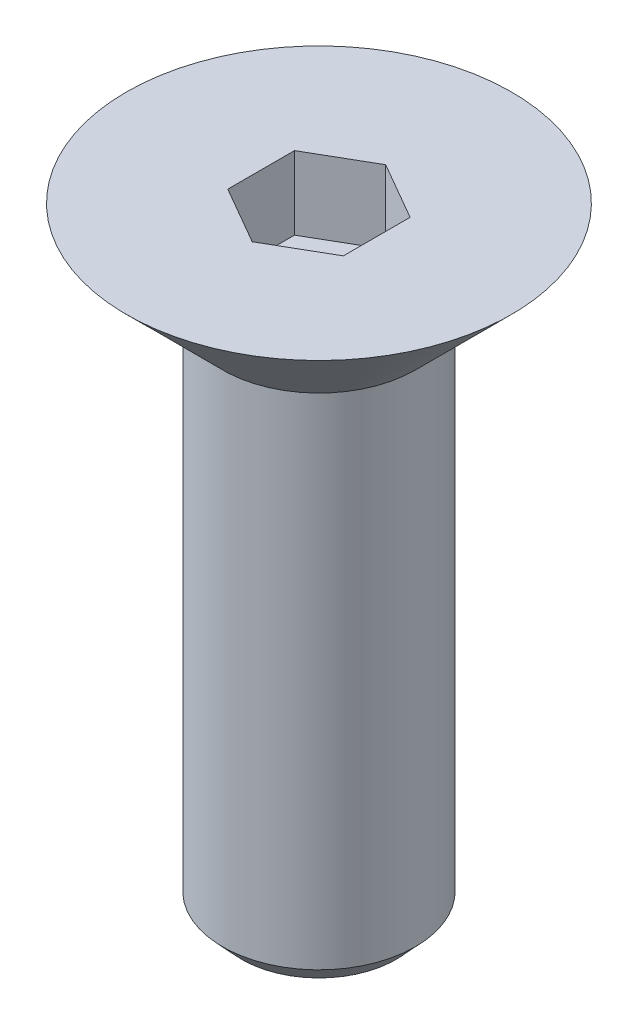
ISO-10303-21;
HEADER;
FILE_DESCRIPTION(('STEP AP214'),'2;1');
FILE_NAME('part.step','',(''),(''),'','','');
FILE_SCHEMA(('AUTOMOTIVE_DESIGN { 1 0 10303 214 1 1 1 1 }'));
ENDSEC;
DATA;
#1=APPLICATION_CONTEXT('core data for automotive mechanical design processes');
#2=APPLICATION_PROTOCOL_DEFINITION('international standard','automotive_design',2000,#1);
#3=PRODUCT_CONTEXT('',#1,'mechanical');
#4=PRODUCT('Part','Part','',(#3));
#5=PRODUCT_RELATED_PRODUCT_CATEGORY('part','',(#4));
#6=PRODUCT_DEFINITION_FORMATION('','',#4);
#7=PRODUCT_DEFINITION_CONTEXT('part definition',#1,'design');
#8=PRODUCT_DEFINITION('design','',#6,#7);
#9=PRODUCT_DEFINITION_SHAPE('','',#8);
#10=(LENGTH_UNIT() NAMED_UNIT(*) SI_UNIT(.MILLI.,.METRE.));
#11=(NAMED_UNIT(*) PLANE_ANGLE_UNIT() SI_UNIT($,.RADIAN.));
#12=(NAMED_UNIT(*) SI_UNIT($,.STERADIAN.) SOLID_ANGLE_UNIT());
#13=UNCERTAINTY_MEASURE_WITH_UNIT(LENGTH_MEASURE(1.E-05),#10,'distance_accuracy_value','');
#14=(GEOMETRIC_REPRESENTATION_CONTEXT(3) GLOBAL_UNCERTAINTY_ASSIGNED_CONTEXT((#13)) GLOBAL_UNIT_ASSIGNED_CONTEXT((#10,
#11,#12)) REPRESENTATION_CONTEXT('',''));
#15=CARTESIAN_POINT('',(0.,0.,0.));
#16=DIRECTION('',(0.,0.,1.));
#17=DIRECTION('',(1.,0.,0.));
#18=AXIS2_PLACEMENT_3D('',#15,#16,#17);
#19=CARTESIAN_POINT('',(-1.49999999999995,-1.90000000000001,0.866025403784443));
#20=DIRECTION('',(-1.,0.,0.));
#21=DIRECTION('',(0.,0.,1.));
#22=AXIS2_PLACEMENT_3D('',#19,#20,#21);
#23=PLANE('',#22);
#24=DIRECTION('',(0.,1.,0.));
#25=VECTOR('',#24,1.);
#26=CARTESIAN_POINT('',(-1.49999999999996,-1.90000000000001,0.86602540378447));
#27=LINE('',#26,#25);
#28=CARTESIAN_POINT('',(-1.49999999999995,0.,0.866025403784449));
#29=VERTEX_POINT('',#28);
#30=CARTESIAN_POINT('',(-1.49999999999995,-1.90000000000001,0.86602540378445));
#31=VERTEX_POINT('',#30);
#32=EDGE_CURVE('E83',#29,#31,#27,.F.);
#33=ORIENTED_EDGE('',*,*,#32,.T.);
#34=DIRECTION('',(0.,0.,1.));
#35=VECTOR('',#34,1.);
#36=CARTESIAN_POINT('',(-1.49999999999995,-1.90000000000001,0.866025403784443));
#37=LINE('',#36,#35);
#38=CARTESIAN_POINT('',(-1.49999999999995,-1.90000000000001,-0.866025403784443));
#39=VERTEX_POINT('',#38);
#40=EDGE_CURVE('E72',#39,#31,#37,.T.);
#41=ORIENTED_EDGE('',*,*,#40,.F.);
#42=DIRECTION('',(0.,1.,0.));
#43=VECTOR('',#42,1.);
#44=CARTESIAN_POINT('',(-1.49999999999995,-1.90000000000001,-0.866025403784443));
#45=LINE('',#44,#43);
#46=CARTESIAN_POINT('',(-1.49999999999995,0.,-0.866025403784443));
#47=VERTEX_POINT('',#46);
#48=EDGE_CURVE('E92',#39,#47,#45,.T.);
#49=ORIENTED_EDGE('',*,*,#48,.T.);
#50=DIRECTION('',(0.,0.,1.));
#51=VECTOR('',#50,1.);
#52=CARTESIAN_POINT('',(-1.49999999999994,0.,0.866025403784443));
#53=LINE('',#52,#51);
#54=EDGE_CURVE('E67',#29,#47,#53,.F.);
#55=ORIENTED_EDGE('',*,*,#54,.F.);
#56=EDGE_LOOP('',(#33,#41,#49,#55));
#57=FACE_BOUND('',#56,.T.);
#58=ADVANCED_FACE('F17',(#57),#23,.F.);
#59=CARTESIAN_POINT('',(0.,-1.90000000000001,1.73205080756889));
#60=DIRECTION('',(-0.5,0.,0.866025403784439));
#61=DIRECTION('',(0.866025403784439,0.,0.5));
#62=AXIS2_PLACEMENT_3D('',#59,#60,#61);
#63=PLANE('',#62);
#64=DIRECTION('',(0.,1.,0.));
#65=VECTOR('',#64,1.);
#66=CARTESIAN_POINT('',(0.,-1.90000000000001,1.73205080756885));
#67=LINE('',#66,#65);
#68=CARTESIAN_POINT('',(0.,0.,1.73205080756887));
#69=VERTEX_POINT('',#68);
#70=CARTESIAN_POINT('',(0.,-1.90000000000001,1.73205080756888));
#71=VERTEX_POINT('',#70);
#72=EDGE_CURVE('E88',#69,#71,#67,.F.);
#73=ORIENTED_EDGE('',*,*,#72,.T.);
#74=DIRECTION('',(0.866025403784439,0.,0.5));
#75=VECTOR('',#74,1.);
#76=CARTESIAN_POINT('',(0.,-1.90000000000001,1.73205080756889));
#77=LINE('',#76,#75);
#78=EDGE_CURVE('E76',#31,#71,#77,.T.);
#79=ORIENTED_EDGE('',*,*,#78,.F.);
#80=ORIENTED_EDGE('',*,*,#32,.F.);
#81=DIRECTION('',(0.866025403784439,0.,0.5));
#82=VECTOR('',#81,1.);
#83=CARTESIAN_POINT('',(0.,0.,1.73205080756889));
#84=LINE('',#83,#82);
#85=EDGE_CURVE('E90',#69,#29,#84,.F.);
#86=ORIENTED_EDGE('',*,*,#85,.F.);
#87=EDGE_LOOP('',(#73,#79,#80,#86));
#88=FACE_BOUND('',#87,.T.);
#89=ADVANCED_FACE('F86',(#88),#63,.F.);
#90=CARTESIAN_POINT('',(-1.49999999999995,-1.90000000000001,-0.866025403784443));
#91=DIRECTION('',(-0.500000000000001,0.,-0.866025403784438));
#92=DIRECTION('',(-0.866025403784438,0.,0.500000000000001));
#93=AXIS2_PLACEMENT_3D('',#90,#91,#92);
#94=PLANE('',#93);
#95=ORIENTED_EDGE('',*,*,#48,.F.);
#96=DIRECTION('',(0.86602540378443,0.,-0.500000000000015));
#97=VECTOR('',#96,1.);
#98=CARTESIAN_POINT('',(-1.49999999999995,-1.90000000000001,-0.866025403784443));
#99=LINE('',#98,#97);
#100=CARTESIAN_POINT('',(0.,-1.90000000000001,-1.73205080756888));
#101=VERTEX_POINT('',#100);
#102=EDGE_CURVE('E79',#39,#101,#99,.T.);
#103=ORIENTED_EDGE('',*,*,#102,.T.);
#104=DIRECTION('',(0.,1.,0.));
#105=VECTOR('',#104,1.);
#106=CARTESIAN_POINT('',(0.,-1.90000000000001,-1.73205080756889));
#107=LINE('',#106,#105);
#108=CARTESIAN_POINT('',(0.,0.,-1.73205080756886));
#109=VERTEX_POINT('',#108);
#110=EDGE_CURVE('E117',#101,#109,#107,.T.);
#111=ORIENTED_EDGE('',*,*,#110,.T.);
#112=DIRECTION('',(-0.866025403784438,0.,0.500000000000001));
#113=VECTOR('',#112,1.);
#114=CARTESIAN_POINT('',(-1.49999999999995,0.,-0.866025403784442));
#115=LINE('',#114,#113);
#116=EDGE_CURVE('E128',#47,#109,#115,.F.);
#117=ORIENTED_EDGE('',*,*,#116,.F.);
#118=EDGE_LOOP('',(#95,#103,#111,#117));
#119=FACE_BOUND('',#118,.T.);
#120=ADVANCED_FACE('F131',(#119),#94,.F.);
#121=CARTESIAN_POINT('',(1.49999999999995,-1.90000000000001,0.866025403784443));
#122=DIRECTION('',(0.500000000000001,0.,0.866025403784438));
#123=DIRECTION('',(0.866025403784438,0.,-0.500000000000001));
#124=AXIS2_PLACEMENT_3D('',#121,#122,#123);
#125=PLANE('',#124);
#126=DIRECTION('',(0.,1.,0.));
#127=VECTOR('',#126,1.);
#128=CARTESIAN_POINT('',(1.49999999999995,-1.90000000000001,0.866025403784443));
#129=LINE('',#128,#127);
#130=CARTESIAN_POINT('',(1.49999999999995,0.,0.866025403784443));
#131=VERTEX_POINT('',#130);
#132=CARTESIAN_POINT('',(1.49999999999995,-1.90000000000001,0.866025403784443));
#133=VERTEX_POINT('',#132);
#134=EDGE_CURVE('E114',#131,#133,#129,.F.);
#135=ORIENTED_EDGE('',*,*,#134,.T.);
#136=DIRECTION('',(-0.86602540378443,0.,0.500000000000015));
#137=VECTOR('',#136,1.);
#138=CARTESIAN_POINT('',(1.49999999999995,-1.90000000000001,0.866025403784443));
#139=LINE('',#138,#137);
#140=EDGE_CURVE('E122',#133,#71,#139,.T.);
#141=ORIENTED_EDGE('',*,*,#140,.T.);
#142=ORIENTED_EDGE('',*,*,#72,.F.);
#143=DIRECTION('',(0.866025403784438,0.,-0.500000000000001));
#144=VECTOR('',#143,1.);
#145=CARTESIAN_POINT('',(1.49999999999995,0.,0.866025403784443));
#146=LINE('',#145,#144);
#147=EDGE_CURVE('E125',#131,#69,#146,.F.);
#148=ORIENTED_EDGE('',*,*,#147,.F.);
#149=EDGE_LOOP('',(#135,#141,#142,#148));
#150=FACE_BOUND('',#149,.T.);
#151=ADVANCED_FACE('F136',(#150),#125,.F.);
#152=CARTESIAN_POINT('',(0.,-1.90000000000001,1.73205080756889));
#153=DIRECTION('',(0.,-1.,0.));
#154=DIRECTION('',(1.,0.,0.));
#155=AXIS2_PLACEMENT_3D('',#152,#153,#154);
#156=PLANE('',#155);
#157=DIRECTION('',(0.,0.,-1.));
#158=VECTOR('',#157,1.);
#159=CARTESIAN_POINT('',(1.49999999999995,-1.90000000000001,-0.866025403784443));
#160=LINE('',#159,#158);
#161=CARTESIAN_POINT('',(1.49999999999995,-1.90000000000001,-0.866025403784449));
#162=VERTEX_POINT('',#161);
#163=EDGE_CURVE('E110',#133,#162,#160,.T.);
#164=ORIENTED_EDGE('',*,*,#163,.T.);
#165=DIRECTION('',(-0.866025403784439,0.,-0.5));
#166=VECTOR('',#165,1.);
#167=CARTESIAN_POINT('',(0.,-1.90000000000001,-1.73205080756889));
#168=LINE('',#167,#166);
#169=EDGE_CURVE('E120',#162,#101,#168,.T.);
#170=ORIENTED_EDGE('',*,*,#169,.T.);
#171=ORIENTED_EDGE('',*,*,#102,.F.);
#172=ORIENTED_EDGE('',*,*,#40,.T.);
#173=ORIENTED_EDGE('',*,*,#78,.T.);
#174=ORIENTED_EDGE('',*,*,#140,.F.);
#175=EDGE_LOOP('',(#164,#170,#171,#172,#173,#174));
#176=FACE_BOUND('',#175,.T.);
#177=ADVANCED_FACE('F73',(#176),#156,.F.);
#178=CARTESIAN_POINT('',(0.,-1.90000000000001,-1.73205080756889));
#179=DIRECTION('',(0.5,0.,-0.866025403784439));
#180=DIRECTION('',(-0.866025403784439,0.,-0.5));
#181=AXIS2_PLACEMENT_3D('',#178,#179,#180);
#182=PLANE('',#181);
#183=ORIENTED_EDGE('',*,*,#110,.F.);
#184=ORIENTED_EDGE('',*,*,#169,.F.);
#185=DIRECTION('',(0.,1.,0.));
#186=VECTOR('',#185,1.);
#187=CARTESIAN_POINT('',(1.49999999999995,-1.90000000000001,-0.866025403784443));
#188=LINE('',#187,#186);
#189=CARTESIAN_POINT('',(1.49999999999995,0.,-0.866025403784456));
#190=VERTEX_POINT('',#189);
#191=EDGE_CURVE('E106',#162,#190,#188,.T.);
#192=ORIENTED_EDGE('',*,*,#191,.T.);
#193=DIRECTION('',(-0.866025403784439,0.,-0.5));
#194=VECTOR('',#193,1.);
#195=CARTESIAN_POINT('',(0.,0.,-1.73205080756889));
#196=LINE('',#195,#194);
#197=EDGE_CURVE('E35',#109,#190,#196,.F.);
#198=ORIENTED_EDGE('',*,*,#197,.F.);
#199=EDGE_LOOP('',(#183,#184,#192,#198));
#200=FACE_BOUND('',#199,.T.);
#201=ADVANCED_FACE('F143',(#200),#182,.F.);
#202=CARTESIAN_POINT('',(1.49999999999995,-1.90000000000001,-0.866025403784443));
#203=DIRECTION('',(1.,0.,0.));
#204=DIRECTION('',(0.,0.,-1.));
#205=AXIS2_PLACEMENT_3D('',#202,#203,#204);
#206=PLANE('',#205);
#207=ORIENTED_EDGE('',*,*,#191,.F.);
#208=ORIENTED_EDGE('',*,*,#163,.F.);
#209=ORIENTED_EDGE('',*,*,#134,.F.);
#210=DIRECTION('',(0.,0.,1.));
#211=VECTOR('',#210,1.);
#212=CARTESIAN_POINT('',(1.49999999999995,0.,0.));
#213=LINE('',#212,#211);
#214=EDGE_CURVE('E103',#190,#131,#213,.T.);
#215=ORIENTED_EDGE('',*,*,#214,.F.);
#216=EDGE_LOOP('',(#207,#208,#209,#215));
#217=FACE_BOUND('',#216,.T.);
#218=ADVANCED_FACE('F141',(#217),#206,.F.);
#219=CARTESIAN_POINT('',(0.,-16.,0.));
#220=DIRECTION('',(0.,1.,0.));
#221=DIRECTION('',(-1.,0.,0.));
#222=AXIS2_PLACEMENT_3D('',#219,#220,#221);
#223=PLANE('',#222);
#224=CARTESIAN_POINT('',(0.,-15.9999999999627,0.));
#225=DIRECTION('',(0.,1.,0.));
#226=DIRECTION('',(-1.,0.,0.));
#227=AXIS2_PLACEMENT_3D('',#224,#225,#226);
#228=CIRCLE('',#227,2.00000000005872);
#229=CARTESIAN_POINT('',(-2.00000000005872,-15.9999999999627,0.));
#230=VERTEX_POINT('',#229);
#231=EDGE_CURVE('E20',#230,#230,#228,.T.);
#232=ORIENTED_EDGE('',*,*,#231,.F.);
#233=EDGE_LOOP('',(#232));
#234=FACE_BOUND('',#233,.T.);
#235=ADVANCED_FACE('F151',(#234),#223,.F.);
#236=CARTESIAN_POINT('',(0.,0.,0.));
#237=DIRECTION('',(0.,1.,0.));
#238=DIRECTION('',(-1.,0.,0.));
#239=AXIS2_PLACEMENT_3D('',#236,#237,#238);
#240=PLANE('',#239);
#241=CARTESIAN_POINT('',(0.,5.68432167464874E-11,0.));
#242=DIRECTION('',(0.,1.,0.));
#243=DIRECTION('',(-1.,0.,0.));
#244=AXIS2_PLACEMENT_3D('',#241,#242,#243);
#245=CIRCLE('',#244,4.99999999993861);
#246=CARTESIAN_POINT('',(-4.99999999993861,5.68411434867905E-11,0.));
#247=VERTEX_POINT('',#246);
#248=EDGE_CURVE('E96',#247,#247,#245,.F.);
#249=ORIENTED_EDGE('',*,*,#248,.F.);
#250=EDGE_LOOP('',(#249));
#251=FACE_BOUND('',#250,.T.);
#252=ORIENTED_EDGE('',*,*,#197,.T.);
#253=ORIENTED_EDGE('',*,*,#214,.T.);
#254=ORIENTED_EDGE('',*,*,#147,.T.);
#255=ORIENTED_EDGE('',*,*,#85,.T.);
#256=ORIENTED_EDGE('',*,*,#54,.T.);
#257=ORIENTED_EDGE('',*,*,#116,.T.);
#258=EDGE_LOOP('',(#252,#253,#254,#255,#256,#257));
#259=FACE_BOUND('',#258,.T.);
#260=ADVANCED_FACE('F133',(#251,#259),#240,.T.);
#261=CARTESIAN_POINT('',(0.,-15.4638156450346,0.));
#262=DIRECTION('',(0.,1.,0.));
#263=DIRECTION('',(-1.,0.,0.));
#264=AXIS2_PLACEMENT_3D('',#261,#262,#263);
#265=CONICAL_SURFACE('',#264,2.49999999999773,0.750491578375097);
#266=ORIENTED_EDGE('',*,*,#231,.T.);
#267=EDGE_LOOP('',(#266));
#268=FACE_BOUND('',#267,.T.);
#269=CARTESIAN_POINT('',(0.,-15.4638156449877,0.));
#270=DIRECTION('',(0.,1.,0.));
#271=DIRECTION('',(-1.,0.,0.));
#272=AXIS2_PLACEMENT_3D('',#269,#270,#271);
#273=CIRCLE('',#272,2.5);
#274=CARTESIAN_POINT('',(-2.5,-15.4638156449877,0.));
#275=VERTEX_POINT('',#274);
#276=EDGE_CURVE('E26',#275,#275,#273,.T.);
#277=ORIENTED_EDGE('',*,*,#276,.F.);
#278=EDGE_LOOP('',(#277));
#279=FACE_BOUND('',#278,.T.);
#280=ADVANCED_FACE('F162',(#268,#279),#265,.T.);
#281=CARTESIAN_POINT('',(0.,5.68432167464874E-11,0.));
#282=DIRECTION('',(0.,1.,0.));
#283=DIRECTION('',(-1.,0.,0.));
#284=AXIS2_PLACEMENT_3D('',#281,#282,#283);
#285=CONICAL_SURFACE('',#284,4.99999999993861,0.78539816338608);
#286=CARTESIAN_POINT('',(0.,-2.5,0.));
#287=DIRECTION('',(0.,1.,0.));
#288=DIRECTION('',(-1.,0.,0.));
#289=AXIS2_PLACEMENT_3D('',#286,#287,#288);
#290=CIRCLE('',#289,2.5);
#291=CARTESIAN_POINT('',(-2.50000000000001,-2.5,0.));
#292=VERTEX_POINT('',#291);
#293=EDGE_CURVE('E11',#292,#292,#290,.F.);
#294=ORIENTED_EDGE('',*,*,#293,.F.);
#295=EDGE_LOOP('',(#294));
#296=FACE_BOUND('',#295,.T.);
#297=ORIENTED_EDGE('',*,*,#248,.T.);
#298=EDGE_LOOP('',(#297));
#299=FACE_BOUND('',#298,.T.);
#300=ADVANCED_FACE('F156',(#296,#299),#285,.T.);
#301=CARTESIAN_POINT('',(0.,-16.,0.));
#302=DIRECTION('',(0.,1.,0.));
#303=DIRECTION('',(-1.,0.,0.));
#304=AXIS2_PLACEMENT_3D('',#301,#302,#303);
#305=CYLINDRICAL_SURFACE('',#304,2.5);
#306=ORIENTED_EDGE('',*,*,#276,.T.);
#307=EDGE_LOOP('',(#306));
#308=FACE_BOUND('',#307,.T.);
#309=ORIENTED_EDGE('',*,*,#293,.T.);
#310=EDGE_LOOP('',(#309));
#311=FACE_BOUND('',#310,.T.);
#312=ADVANCED_FACE('F154',(#308,#311),#305,.T.);
#313=CLOSED_SHELL('',(#58,#89,#120,#151,#177,#201,#218,#235,#260,#280,#300,#312));
#314=MANIFOLD_SOLID_BREP('B1',#313);
#315=ADVANCED_BREP_SHAPE_REPRESENTATION('',(#18,#314),#14);
#316=SHAPE_DEFINITION_REPRESENTATION(#9,#315);
ENDSEC;
END-ISO-10303-21;
